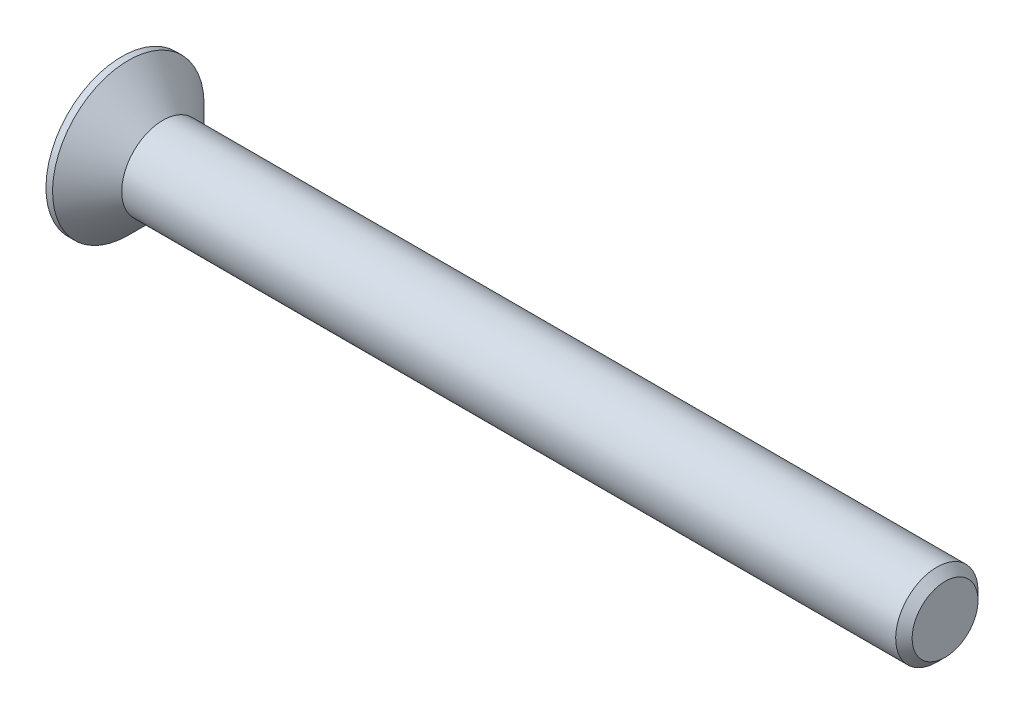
from build123d import *

# Parameters (mm, degrees)
CHAMFER1_SIZE      = 0.5
CUT_EXTRUDE1_DEPTH = 2.1


with BuildPart() as part:
    # Sketch1 → Revolve1 (revolve)
    with BuildSketch(Plane.XY, mode=Mode.PRIVATE) as revolve1_sk:
        Polygon((-2.5, 4.6), (-2.5, 0), (47.5, 0), (47.5, 2.5), (0, 2.5), (-2.1, 4.6), align=None)
    revolve(revolve1_sk.sketch.rotate(Axis((-2.5, 0, 0), (1, 0, 0)), 180), axis=Axis((-2.5, 0, 0), (1, 0, 0)))

    # Chamfer1
    chamfer1_edges = [part.edges().sort_by_distance(p)[0] for p in [
        (47.5, 2.5, 0),
    ]]
    chamfer(chamfer1_edges, length=CHAMFER1_SIZE)

    # Sketch2 → Cut-Extrude1 (cut)
    with BuildSketch(Plane.ZY.offset(2.5)):
        Polygon((-0.575, 2.3), (0.575, 2.3), (0.575, 0.575), (2.3, 0.575), (2.3, -0.575), (0.575, -0.575), (0.575, -2.3), (-0.575, -2.3), (-0.575, -0.575), (-2.3, -0.575), (-2.3, 0.575), (-0.575, 0.575), align=None)
    extrude(amount=-CUT_EXTRUDE1_DEPTH, mode=Mode.SUBTRACT)


solid = part.part
